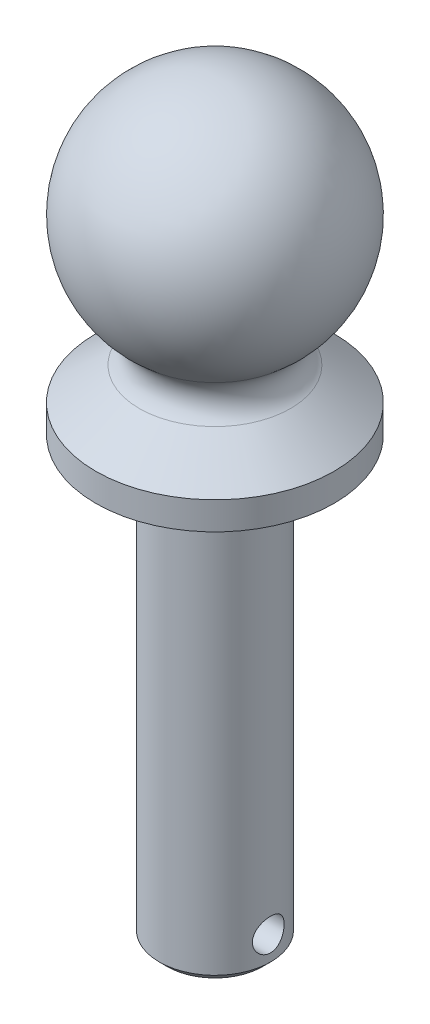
ISO-10303-21;
HEADER;
FILE_DESCRIPTION(('STEP AP214'),'2;1');
FILE_NAME('part.step','',(''),(''),'','','');
FILE_SCHEMA(('AUTOMOTIVE_DESIGN { 1 0 10303 214 1 1 1 1 }'));
ENDSEC;
DATA;
#1=APPLICATION_CONTEXT('core data for automotive mechanical design processes');
#2=APPLICATION_PROTOCOL_DEFINITION('international standard','automotive_design',2000,#1);
#3=PRODUCT_CONTEXT('',#1,'mechanical');
#4=PRODUCT('Part','Part','',(#3));
#5=PRODUCT_RELATED_PRODUCT_CATEGORY('part','',(#4));
#6=PRODUCT_DEFINITION_FORMATION('','',#4);
#7=PRODUCT_DEFINITION_CONTEXT('part definition',#1,'design');
#8=PRODUCT_DEFINITION('design','',#6,#7);
#9=PRODUCT_DEFINITION_SHAPE('','',#8);
#10=(LENGTH_UNIT() NAMED_UNIT(*) SI_UNIT(.MILLI.,.METRE.));
#11=(NAMED_UNIT(*) PLANE_ANGLE_UNIT() SI_UNIT($,.RADIAN.));
#12=(NAMED_UNIT(*) SI_UNIT($,.STERADIAN.) SOLID_ANGLE_UNIT());
#13=UNCERTAINTY_MEASURE_WITH_UNIT(LENGTH_MEASURE(1.E-05),#10,'distance_accuracy_value','');
#14=(GEOMETRIC_REPRESENTATION_CONTEXT(3) GLOBAL_UNCERTAINTY_ASSIGNED_CONTEXT((#13)) GLOBAL_UNIT_ASSIGNED_CONTEXT((#10,
#11,#12)) REPRESENTATION_CONTEXT('',''));
#15=CARTESIAN_POINT('',(0.,0.,0.));
#16=DIRECTION('',(0.,0.,1.));
#17=DIRECTION('',(1.,0.,0.));
#18=AXIS2_PLACEMENT_3D('',#15,#16,#17);
#19=CARTESIAN_POINT('',(0.,0.,0.));
#20=DIRECTION('',(0.,1.,0.));
#21=DIRECTION('',(1.,0.,0.));
#22=AXIS2_PLACEMENT_3D('',#19,#20,#21);
#23=SPHERICAL_SURFACE('',#22,15.);
#24=CARTESIAN_POINT('',(0.,-11.659704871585,0.));
#25=DIRECTION('',(0.,1.,0.));
#26=DIRECTION('',(0.,0.,1.));
#27=AXIS2_PLACEMENT_3D('',#24,#25,#26);
#28=CIRCLE('',#27,9.43669869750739);
#29=CARTESIAN_POINT('',(0.,-11.659704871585,9.43669869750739));
#30=VERTEX_POINT('',#29);
#31=EDGE_CURVE('E12',#30,#30,#28,.T.);
#32=ORIENTED_EDGE('',*,*,#31,.T.);
#33=EDGE_LOOP('',(#32));
#34=FACE_BOUND('',#33,.T.);
#35=ADVANCED_FACE('F38',(#34),#23,.T.);
#36=CARTESIAN_POINT('',(0.,-13.991645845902,0.));
#37=DIRECTION('',(0.,1.,0.));
#38=DIRECTION('',(0.,0.,1.));
#39=AXIS2_PLACEMENT_3D('',#36,#37,#38);
#40=TOROIDAL_SURFACE('',#39,11.3240384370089,3.);
#41=CARTESIAN_POINT('',(0.,-16.3913549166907,0.));
#42=DIRECTION('',(0.,1.,0.));
#43=DIRECTION('',(0.,0.,1.));
#44=AXIS2_PLACEMENT_3D('',#41,#42,#43);
#45=CIRCLE('',#44,9.52365059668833);
#46=CARTESIAN_POINT('',(0.,-16.3913549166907,9.52365059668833));
#47=VERTEX_POINT('',#46);
#48=EDGE_CURVE('E49',#47,#47,#45,.T.);
#49=ORIENTED_EDGE('',*,*,#48,.T.);
#50=EDGE_LOOP('',(#49));
#51=FACE_BOUND('',#50,.T.);
#52=ORIENTED_EDGE('',*,*,#31,.F.);
#53=EDGE_LOOP('',(#52));
#54=FACE_BOUND('',#53,.T.);
#55=ADVANCED_FACE('F85',(#51,#54),#40,.F.);
#56=CARTESIAN_POINT('',(0.,-16.3913549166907,0.));
#57=DIRECTION('',(0.,-1.,0.));
#58=DIRECTION('',(0.,0.,-1.));
#59=AXIS2_PLACEMENT_3D('',#56,#57,#58);
#60=CONICAL_SURFACE('',#59,9.52365059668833,0.927133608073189);
#61=CARTESIAN_POINT('',(0.,-20.5,0.));
#62=DIRECTION('',(0.,1.,0.));
#63=DIRECTION('',(0.,0.,1.));
#64=AXIS2_PLACEMENT_3D('',#61,#62,#63);
#65=CIRCLE('',#64,15.);
#66=CARTESIAN_POINT('',(0.,-20.5,15.));
#67=VERTEX_POINT('',#66);
#68=EDGE_CURVE('E54',#67,#67,#65,.T.);
#69=ORIENTED_EDGE('',*,*,#68,.T.);
#70=EDGE_LOOP('',(#69));
#71=FACE_BOUND('',#70,.T.);
#72=ORIENTED_EDGE('',*,*,#48,.F.);
#73=EDGE_LOOP('',(#72));
#74=FACE_BOUND('',#73,.T.);
#75=ADVANCED_FACE('F89',(#71,#74),#60,.T.);
#76=CARTESIAN_POINT('',(0.,-80.,0.));
#77=DIRECTION('',(0.,1.,0.));
#78=DIRECTION('',(0.,0.,1.));
#79=AXIS2_PLACEMENT_3D('',#76,#77,#78);
#80=CYLINDRICAL_SURFACE('',#79,15.);
#81=CARTESIAN_POINT('',(0.,-24.,0.));
#82=DIRECTION('',(0.,1.,0.));
#83=DIRECTION('',(0.,0.,1.));
#84=AXIS2_PLACEMENT_3D('',#81,#82,#83);
#85=CIRCLE('',#84,15.);
#86=CARTESIAN_POINT('',(0.,-24.,15.));
#87=VERTEX_POINT('',#86);
#88=EDGE_CURVE('E111',#87,#87,#85,.T.);
#89=ORIENTED_EDGE('',*,*,#88,.T.);
#90=EDGE_LOOP('',(#89));
#91=FACE_BOUND('',#90,.T.);
#92=ORIENTED_EDGE('',*,*,#68,.F.);
#93=EDGE_LOOP('',(#92));
#94=FACE_BOUND('',#93,.T.);
#95=ADVANCED_FACE('F94',(#91,#94),#80,.T.);
#96=CARTESIAN_POINT('',(-7.,-24.,0.));
#97=DIRECTION('',(0.,-1.,0.));
#98=DIRECTION('',(0.,0.,-1.));
#99=AXIS2_PLACEMENT_3D('',#96,#97,#98);
#100=PLANE('',#99);
#101=CARTESIAN_POINT('',(0.,-24.,0.));
#102=DIRECTION('',(0.,1.,0.));
#103=DIRECTION('',(0.,0.,1.));
#104=AXIS2_PLACEMENT_3D('',#101,#102,#103);
#105=CIRCLE('',#104,7.);
#106=CARTESIAN_POINT('',(0.,-24.,7.));
#107=VERTEX_POINT('',#106);
#108=EDGE_CURVE('E108',#107,#107,#105,.T.);
#109=ORIENTED_EDGE('',*,*,#108,.T.);
#110=EDGE_LOOP('',(#109));
#111=FACE_BOUND('',#110,.T.);
#112=ORIENTED_EDGE('',*,*,#88,.F.);
#113=EDGE_LOOP('',(#112));
#114=FACE_BOUND('',#113,.T.);
#115=ADVANCED_FACE('F80',(#111,#114),#100,.T.);
#116=CARTESIAN_POINT('',(0.,-80.,0.));
#117=DIRECTION('',(0.,1.,0.));
#118=DIRECTION('',(0.,0.,1.));
#119=AXIS2_PLACEMENT_3D('',#116,#117,#118);
#120=CYLINDRICAL_SURFACE('',#119,7.);
#121=CARTESIAN_POINT('',(-6.70820393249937,-75.,-2.));
#122=CARTESIAN_POINT('',(-6.70820547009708,-75.1098515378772,-1.99999802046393));
#123=CARTESIAN_POINT('',(-6.71093179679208,-75.2197230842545,-1.9909186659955));
#124=CARTESIAN_POINT('',(-6.72150389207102,-75.436271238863,-1.95492363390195));
#125=CARTESIAN_POINT('',(-6.72935174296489,-75.5429465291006,-1.92800070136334));
#126=CARTESIAN_POINT('',(-6.74920709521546,-75.7499372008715,-1.85729343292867));
#127=CARTESIAN_POINT('',(-6.76120815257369,-75.8502621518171,-1.81353520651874));
#128=CARTESIAN_POINT('',(-6.78800921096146,-76.0421678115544,-1.71048364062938));
#129=CARTESIAN_POINT('',(-6.80280954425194,-76.133747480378,-1.65118845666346));
#130=CARTESIAN_POINT('',(-6.83401783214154,-76.3081915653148,-1.51692480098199));
#131=CARTESIAN_POINT('',(-6.8504575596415,-76.3907678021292,-1.4415892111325));
#132=CARTESIAN_POINT('',(-6.88281965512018,-76.5423027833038,-1.27817124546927));
#133=CARTESIAN_POINT('',(-6.89874196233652,-76.6112599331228,-1.19008737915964));
#134=CARTESIAN_POINT('',(-6.92863332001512,-76.7348286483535,-1.00164603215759));
#135=CARTESIAN_POINT('',(-6.94256054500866,-76.789149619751,-0.90109078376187));
#136=CARTESIAN_POINT('',(-6.96652540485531,-76.880001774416,-0.691808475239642));
#137=CARTESIAN_POINT('',(-6.97656379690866,-76.9165364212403,-0.583083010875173));
#138=CARTESIAN_POINT('',(-6.99139519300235,-76.9698344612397,-0.363558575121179));
#139=CARTESIAN_POINT('',(-6.99631827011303,-76.9870890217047,-0.252887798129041));
#140=CARTESIAN_POINT('',(-7.00082095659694,-77.0028867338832,-0.0301201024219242));
#141=CARTESIAN_POINT('',(-7.00040158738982,-77.0014334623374,0.0819765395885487));
#142=CARTESIAN_POINT('',(-6.99436006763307,-76.980193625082,0.300980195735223));
#143=CARTESIAN_POINT('',(-6.98888870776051,-76.960938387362,0.40794354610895));
#144=CARTESIAN_POINT('',(-6.97353886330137,-76.9055048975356,0.61705222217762));
#145=CARTESIAN_POINT('',(-6.96366011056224,-76.8693256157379,0.719197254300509));
#146=CARTESIAN_POINT('',(-6.94039031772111,-76.7806905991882,0.917073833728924));
#147=CARTESIAN_POINT('',(-6.92696205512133,-76.7280612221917,1.01272304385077));
#148=CARTESIAN_POINT('',(-6.89802768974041,-76.608155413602,1.19400724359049));
#149=CARTESIAN_POINT('',(-6.8825211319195,-76.5408757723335,1.27964003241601));
#150=CARTESIAN_POINT('',(-6.85045683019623,-76.3907942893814,1.44163264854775));
#151=CARTESIAN_POINT('',(-6.83388129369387,-76.3075305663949,1.5175615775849));
#152=CARTESIAN_POINT('',(-6.80202973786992,-76.129284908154,1.65449301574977));
#153=CARTESIAN_POINT('',(-6.78675382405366,-76.034302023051,1.71549431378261));
#154=CARTESIAN_POINT('',(-6.75915174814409,-75.834269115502,1.82123335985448));
#155=CARTESIAN_POINT('',(-6.74685010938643,-75.7291447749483,1.86583737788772));
#156=CARTESIAN_POINT('',(-6.72688544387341,-75.5124468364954,1.9365895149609));
#157=CARTESIAN_POINT('',(-6.71922106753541,-75.4008751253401,1.9627430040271));
#158=CARTESIAN_POINT('',(-6.70969115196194,-75.1785195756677,1.99507417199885));
#159=CARTESIAN_POINT('',(-6.70763711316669,-75.067838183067,2.00190148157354));
#160=CARTESIAN_POINT('',(-6.7090415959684,-74.846911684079,1.99718996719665));
#161=CARTESIAN_POINT('',(-6.71249942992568,-74.7366665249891,1.98565343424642));
#162=CARTESIAN_POINT('',(-6.72435430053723,-74.5223587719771,1.94511781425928));
#163=CARTESIAN_POINT('',(-6.73263642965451,-74.4182124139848,1.9165246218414));
#164=CARTESIAN_POINT('',(-6.75309063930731,-74.2161981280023,1.8431516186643));
#165=CARTESIAN_POINT('',(-6.7652632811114,-74.1183311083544,1.79836947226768));
#166=CARTESIAN_POINT('',(-6.79250188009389,-73.9289779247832,1.69261965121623));
#167=CARTESIAN_POINT('',(-6.80763197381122,-73.8377095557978,1.63127891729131));
#168=CARTESIAN_POINT('',(-6.83893726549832,-73.6665236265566,1.49460463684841));
#169=CARTESIAN_POINT('',(-6.85511268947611,-73.5866085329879,1.41926805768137));
#170=CARTESIAN_POINT('',(-6.88734727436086,-73.4376205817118,1.25370800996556));
#171=CARTESIAN_POINT('',(-6.90338406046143,-73.3690050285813,1.16306771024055));
#172=CARTESIAN_POINT('',(-6.93297977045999,-73.2479543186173,0.971185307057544));
#173=CARTESIAN_POINT('',(-6.94653882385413,-73.1955183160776,0.869943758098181));
#174=CARTESIAN_POINT('',(-6.96956504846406,-73.1088157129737,0.660433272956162));
#175=CARTESIAN_POINT('',(-6.97906308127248,-73.0744116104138,0.552224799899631));
#176=CARTESIAN_POINT('',(-6.99303339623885,-73.0243731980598,0.33124564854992));
#177=CARTESIAN_POINT('',(-6.99750697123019,-73.0087340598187,0.218476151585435));
#178=CARTESIAN_POINT('',(-7.00085335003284,-72.9970085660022,-0.00417823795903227));
#179=CARTESIAN_POINT('',(-6.99991703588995,-73.0002558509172,-0.11402563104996));
#180=CARTESIAN_POINT('',(-6.99299069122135,-73.0246382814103,-0.331545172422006));
#181=CARTESIAN_POINT('',(-6.98700090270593,-73.045772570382,-0.439217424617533));
#182=CARTESIAN_POINT('',(-6.97068801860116,-73.1049313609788,-0.648404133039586));
#183=CARTESIAN_POINT('',(-6.96040414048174,-73.142803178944,-0.749965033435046));
#184=CARTESIAN_POINT('',(-6.93657094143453,-73.2342261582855,-0.945347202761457));
#185=CARTESIAN_POINT('',(-6.92302111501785,-73.2877797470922,-1.03916727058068));
#186=CARTESIAN_POINT('',(-6.89358955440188,-73.4108973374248,-1.2194334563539));
#187=CARTESIAN_POINT('',(-6.8776504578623,-73.4808900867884,-1.30557732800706));
#188=CARTESIAN_POINT('',(-6.84544064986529,-73.6341091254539,-1.46512122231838));
#189=CARTESIAN_POINT('',(-6.82916984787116,-73.7173390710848,-1.5385177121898));
#190=CARTESIAN_POINT('',(-6.79764037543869,-73.8972969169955,-1.67240846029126));
#191=CARTESIAN_POINT('',(-6.78241951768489,-73.9943219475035,-1.73251316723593));
#192=CARTESIAN_POINT('',(-6.7552844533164,-74.1975218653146,-1.83547943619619));
#193=CARTESIAN_POINT('',(-6.74336839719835,-74.3036915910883,-1.8783506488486));
#194=CARTESIAN_POINT('',(-6.72558459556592,-74.5076537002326,-1.94098534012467));
#195=CARTESIAN_POINT('',(-6.71912438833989,-74.6046903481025,-1.96305899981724));
#196=CARTESIAN_POINT('',(-6.71043369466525,-74.8011461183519,-1.99256607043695));
#197=CARTESIAN_POINT('',(-6.70820254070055,-74.9005648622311,-2.00000179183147));
#198=CARTESIAN_POINT('',(-6.70820393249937,-75.,-2.));
#199=B_SPLINE_CURVE_WITH_KNOTS('',3,(#121,#122,#123,#124,#125,#126,#127,#128,#129,#130,#131,
#132,#133,#134,#135,#136,#137,#138,#139,#140,#141,#142,#143,#144,#145,#146,#147,#148,#149,#150,
#151,#152,#153,#154,#155,#156,#157,#158,#159,#160,#161,#162,#163,#164,#165,#166,#167,#168,#169,
#170,#171,#172,#173,#174,#175,#176,#177,#178,#179,#180,#181,#182,#183,#184,#185,#186,#187,#188,
#189,#190,#191,#192,#193,#194,#195,#196,#197,#198),.UNSPECIFIED.,.T.,.F.,(4,2,2,2,2,2,2,2,2,2,2,
2,2,2,2,2,2,2,2,2,2,2,2,2,2,2,2,2,2,2,2,2,2,2,2,2,2,2,4),(0.,0.329188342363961,
0.658510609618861,0.987324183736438,1.31617681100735,1.65357167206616,1.99100601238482,
2.33471483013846,2.67835669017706,3.01302901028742,3.34763734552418,3.67257037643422,
3.99752317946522,4.32602903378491,4.65460693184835,4.99471612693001,5.33485290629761,
5.67770520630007,6.02045767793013,6.35154363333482,6.68258828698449,7.00605289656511,
7.32956419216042,7.66108006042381,7.99266784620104,8.33545388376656,8.67822200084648,
9.01833685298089,9.35836417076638,9.6864689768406,10.0145580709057,10.3397141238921,
10.6649205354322,10.9997976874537,11.3347674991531,11.6785361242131,12.0221119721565,
12.3201328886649,12.61810676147),.UNSPECIFIED.);
#200=CARTESIAN_POINT('',(-6.70820393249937,-75.,-2.));
#201=VERTEX_POINT('',#200);
#202=EDGE_CURVE('E41',#201,#201,#199,.T.);
#203=ORIENTED_EDGE('',*,*,#202,.F.);
#204=EDGE_LOOP('',(#203));
#205=FACE_BOUND('',#204,.T.);
#206=CARTESIAN_POINT('',(6.70820393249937,-75.,-2.));
#207=CARTESIAN_POINT('',(6.70820547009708,-74.8901484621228,-1.99999802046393));
#208=CARTESIAN_POINT('',(6.71093179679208,-74.7802769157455,-1.9909186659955));
#209=CARTESIAN_POINT('',(6.72150389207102,-74.563728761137,-1.95492363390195));
#210=CARTESIAN_POINT('',(6.72935174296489,-74.4570534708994,-1.92800070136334));
#211=CARTESIAN_POINT('',(6.74920709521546,-74.2500627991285,-1.85729343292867));
#212=CARTESIAN_POINT('',(6.76120815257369,-74.1497378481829,-1.81353520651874));
#213=CARTESIAN_POINT('',(6.78800921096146,-73.9578321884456,-1.71048364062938));
#214=CARTESIAN_POINT('',(6.80280954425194,-73.866252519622,-1.65118845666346));
#215=CARTESIAN_POINT('',(6.83401783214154,-73.6918084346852,-1.51692480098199));
#216=CARTESIAN_POINT('',(6.8504575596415,-73.6092321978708,-1.4415892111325));
#217=CARTESIAN_POINT('',(6.88281965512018,-73.4576972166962,-1.27817124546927));
#218=CARTESIAN_POINT('',(6.89874196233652,-73.3887400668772,-1.19008737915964));
#219=CARTESIAN_POINT('',(6.92863332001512,-73.2651713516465,-1.00164603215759));
#220=CARTESIAN_POINT('',(6.94256054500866,-73.210850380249,-0.90109078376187));
#221=CARTESIAN_POINT('',(6.96652540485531,-73.119998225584,-0.691808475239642));
#222=CARTESIAN_POINT('',(6.97656379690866,-73.0834635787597,-0.583083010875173));
#223=CARTESIAN_POINT('',(6.99139519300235,-73.0301655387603,-0.363558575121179));
#224=CARTESIAN_POINT('',(6.99631827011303,-73.0129109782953,-0.252887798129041));
#225=CARTESIAN_POINT('',(7.00082095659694,-72.9971132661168,-0.0301201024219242));
#226=CARTESIAN_POINT('',(7.00040158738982,-72.9985665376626,0.0819765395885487));
#227=CARTESIAN_POINT('',(6.99436006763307,-73.019806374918,0.300980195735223));
#228=CARTESIAN_POINT('',(6.98888870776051,-73.039061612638,0.40794354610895));
#229=CARTESIAN_POINT('',(6.97353886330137,-73.0944951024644,0.61705222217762));
#230=CARTESIAN_POINT('',(6.96366011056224,-73.1306743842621,0.719197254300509));
#231=CARTESIAN_POINT('',(6.94039031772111,-73.2193094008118,0.917073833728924));
#232=CARTESIAN_POINT('',(6.92696205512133,-73.2719387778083,1.01272304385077));
#233=CARTESIAN_POINT('',(6.89802768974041,-73.391844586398,1.19400724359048));
#234=CARTESIAN_POINT('',(6.8825211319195,-73.4591242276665,1.27964003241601));
#235=CARTESIAN_POINT('',(6.85045683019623,-73.6092057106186,1.44163264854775));
#236=CARTESIAN_POINT('',(6.83388129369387,-73.692469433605,1.51756157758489));
#237=CARTESIAN_POINT('',(6.80202973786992,-73.870715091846,1.65449301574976));
#238=CARTESIAN_POINT('',(6.78675382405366,-73.965697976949,1.71549431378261));
#239=CARTESIAN_POINT('',(6.75915174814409,-74.165730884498,1.82123335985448));
#240=CARTESIAN_POINT('',(6.74685010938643,-74.2708552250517,1.86583737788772));
#241=CARTESIAN_POINT('',(6.72688544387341,-74.4875531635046,1.9365895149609));
#242=CARTESIAN_POINT('',(6.71922106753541,-74.5991248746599,1.9627430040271));
#243=CARTESIAN_POINT('',(6.70969115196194,-74.8214804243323,1.99507417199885));
#244=CARTESIAN_POINT('',(6.70763711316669,-74.932161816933,2.00190148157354));
#245=CARTESIAN_POINT('',(6.7090415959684,-75.153088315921,1.99718996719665));
#246=CARTESIAN_POINT('',(6.71249942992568,-75.2633334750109,1.98565343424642));
#247=CARTESIAN_POINT('',(6.72435430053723,-75.4776412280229,1.94511781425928));
#248=CARTESIAN_POINT('',(6.73263642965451,-75.5817875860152,1.9165246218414));
#249=CARTESIAN_POINT('',(6.75309063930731,-75.7838018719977,1.8431516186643));
#250=CARTESIAN_POINT('',(6.7652632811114,-75.8816688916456,1.79836947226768));
#251=CARTESIAN_POINT('',(6.79250188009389,-76.0710220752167,1.69261965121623));
#252=CARTESIAN_POINT('',(6.80763197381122,-76.1622904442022,1.63127891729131));
#253=CARTESIAN_POINT('',(6.83893726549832,-76.3334763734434,1.49460463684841));
#254=CARTESIAN_POINT('',(6.85511268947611,-76.4133914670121,1.41926805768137));
#255=CARTESIAN_POINT('',(6.88734727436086,-76.5623794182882,1.25370800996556));
#256=CARTESIAN_POINT('',(6.90338406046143,-76.6309949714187,1.16306771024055));
#257=CARTESIAN_POINT('',(6.93297977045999,-76.7520456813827,0.971185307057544));
#258=CARTESIAN_POINT('',(6.94653882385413,-76.8044816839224,0.869943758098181));
#259=CARTESIAN_POINT('',(6.96956504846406,-76.8911842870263,0.660433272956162));
#260=CARTESIAN_POINT('',(6.97906308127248,-76.9255883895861,0.552224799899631));
#261=CARTESIAN_POINT('',(6.99303339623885,-76.9756268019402,0.33124564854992));
#262=CARTESIAN_POINT('',(6.99750697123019,-76.9912659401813,0.218476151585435));
#263=CARTESIAN_POINT('',(7.00085335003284,-77.0029914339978,-0.00417823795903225));
#264=CARTESIAN_POINT('',(6.99991703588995,-76.9997441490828,-0.11402563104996));
#265=CARTESIAN_POINT('',(6.99299069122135,-76.9753617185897,-0.331545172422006));
#266=CARTESIAN_POINT('',(6.98700090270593,-76.954227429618,-0.439217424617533));
#267=CARTESIAN_POINT('',(6.97068801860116,-76.8950686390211,-0.648404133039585));
#268=CARTESIAN_POINT('',(6.96040414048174,-76.857196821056,-0.749965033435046));
#269=CARTESIAN_POINT('',(6.93657094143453,-76.7657738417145,-0.945347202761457));
#270=CARTESIAN_POINT('',(6.92302111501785,-76.7122202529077,-1.03916727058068));
#271=CARTESIAN_POINT('',(6.89358955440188,-76.5891026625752,-1.2194334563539));
#272=CARTESIAN_POINT('',(6.8776504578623,-76.5191099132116,-1.30557732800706));
#273=CARTESIAN_POINT('',(6.8454406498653,-76.3658908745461,-1.46512122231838));
#274=CARTESIAN_POINT('',(6.82916984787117,-76.2826609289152,-1.5385177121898));
#275=CARTESIAN_POINT('',(6.79764037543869,-76.1027030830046,-1.67240846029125));
#276=CARTESIAN_POINT('',(6.7824195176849,-76.0056780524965,-1.73251316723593));
#277=CARTESIAN_POINT('',(6.7552844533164,-75.8024781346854,-1.83547943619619));
#278=CARTESIAN_POINT('',(6.74336839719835,-75.6963084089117,-1.8783506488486));
#279=CARTESIAN_POINT('',(6.72558459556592,-75.4923462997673,-1.94098534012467));
#280=CARTESIAN_POINT('',(6.71912438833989,-75.3953096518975,-1.96305899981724));
#281=CARTESIAN_POINT('',(6.71043369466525,-75.1988538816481,-1.99256607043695));
#282=CARTESIAN_POINT('',(6.70820254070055,-75.0994351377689,-2.00000179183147));
#283=CARTESIAN_POINT('',(6.70820393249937,-75.,-2.));
#284=B_SPLINE_CURVE_WITH_KNOTS('',3,(#206,#207,#208,#209,#210,#211,#212,#213,#214,#215,#216,
#217,#218,#219,#220,#221,#222,#223,#224,#225,#226,#227,#228,#229,#230,#231,#232,#233,#234,#235,
#236,#237,#238,#239,#240,#241,#242,#243,#244,#245,#246,#247,#248,#249,#250,#251,#252,#253,#254,
#255,#256,#257,#258,#259,#260,#261,#262,#263,#264,#265,#266,#267,#268,#269,#270,#271,#272,#273,
#274,#275,#276,#277,#278,#279,#280,#281,#282,#283),.UNSPECIFIED.,.T.,.F.,(4,2,2,2,2,2,2,2,2,2,2,
2,2,2,2,2,2,2,2,2,2,2,2,2,2,2,2,2,2,2,2,2,2,2,2,2,2,2,4),(0.,0.329188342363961,
0.658510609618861,0.987324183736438,1.31617681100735,1.65357167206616,1.99100601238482,
2.33471483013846,2.67835669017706,3.01302901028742,3.34763734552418,3.67257037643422,
3.99752317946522,4.32602903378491,4.65460693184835,4.99471612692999,5.33485290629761,
5.67770520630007,6.02045767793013,6.35154363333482,6.68258828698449,7.00605289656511,
7.32956419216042,7.66108006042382,7.99266784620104,8.33545388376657,8.67822200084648,
9.0183368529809,9.35836417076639,9.68646897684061,10.0145580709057,10.3397141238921,
10.6649205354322,10.9997976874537,11.3347674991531,11.678536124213,12.0221119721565,
12.3201328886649,12.61810676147),.UNSPECIFIED.);
#285=CARTESIAN_POINT('',(6.70820393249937,-75.,-2.));
#286=VERTEX_POINT('',#285);
#287=EDGE_CURVE('E57',#286,#286,#284,.T.);
#288=ORIENTED_EDGE('',*,*,#287,.F.);
#289=EDGE_LOOP('',(#288));
#290=FACE_BOUND('',#289,.T.);
#291=CARTESIAN_POINT('',(0.,-78.,0.));
#292=DIRECTION('',(0.,1.,0.));
#293=DIRECTION('',(0.,0.,1.));
#294=AXIS2_PLACEMENT_3D('',#291,#292,#293);
#295=CIRCLE('',#294,7.);
#296=CARTESIAN_POINT('',(0.,-78.,7.));
#297=VERTEX_POINT('',#296);
#298=EDGE_CURVE('E114',#297,#297,#295,.T.);
#299=ORIENTED_EDGE('',*,*,#298,.T.);
#300=EDGE_LOOP('',(#299));
#301=FACE_BOUND('',#300,.T.);
#302=ORIENTED_EDGE('',*,*,#108,.F.);
#303=EDGE_LOOP('',(#302));
#304=FACE_BOUND('',#303,.T.);
#305=ADVANCED_FACE('F61',(#205,#290,#301,#304),#120,.T.);
#306=CARTESIAN_POINT('',(0.,-78.,0.));
#307=DIRECTION('',(0.,1.,0.));
#308=DIRECTION('',(0.,0.,1.));
#309=AXIS2_PLACEMENT_3D('',#306,#307,#308);
#310=CONICAL_SURFACE('',#309,7.,0.785398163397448);
#311=CARTESIAN_POINT('',(0.,-79.,0.));
#312=DIRECTION('',(0.,1.,0.));
#313=DIRECTION('',(0.,0.,1.));
#314=AXIS2_PLACEMENT_3D('',#311,#312,#313);
#315=CIRCLE('',#314,6.);
#316=CARTESIAN_POINT('',(0.,-79.,6.));
#317=VERTEX_POINT('',#316);
#318=EDGE_CURVE('E119',#317,#317,#315,.T.);
#319=ORIENTED_EDGE('',*,*,#318,.T.);
#320=EDGE_LOOP('',(#319));
#321=FACE_BOUND('',#320,.T.);
#322=ORIENTED_EDGE('',*,*,#298,.F.);
#323=EDGE_LOOP('',(#322));
#324=FACE_BOUND('',#323,.T.);
#325=ADVANCED_FACE('F73',(#321,#324),#310,.T.);
#326=CARTESIAN_POINT('',(0.,-79.,0.));
#327=DIRECTION('',(0.,-1.,0.));
#328=DIRECTION('',(0.,0.,-1.));
#329=AXIS2_PLACEMENT_3D('',#326,#327,#328);
#330=PLANE('',#329);
#331=ORIENTED_EDGE('',*,*,#318,.F.);
#332=EDGE_LOOP('',(#331));
#333=FACE_BOUND('',#332,.T.);
#334=ADVANCED_FACE('F69',(#333),#330,.T.);
#335=CARTESIAN_POINT('',(-15.,-75.,0.));
#336=DIRECTION('',(1.,0.,0.));
#337=DIRECTION('',(0.,0.,-1.));
#338=AXIS2_PLACEMENT_3D('',#335,#336,#337);
#339=CYLINDRICAL_SURFACE('',#338,2.);
#340=ORIENTED_EDGE('',*,*,#202,.T.);
#341=EDGE_LOOP('',(#340));
#342=FACE_BOUND('',#341,.T.);
#343=ORIENTED_EDGE('',*,*,#287,.T.);
#344=EDGE_LOOP('',(#343));
#345=FACE_BOUND('',#344,.T.);
#346=ADVANCED_FACE('F65',(#342,#345),#339,.F.);
#347=CLOSED_SHELL('',(#35,#55,#75,#95,#115,#305,#325,#334,#346));
#348=MANIFOLD_SOLID_BREP('B2',#347);
#349=ADVANCED_BREP_SHAPE_REPRESENTATION('',(#18,#348),#14);
#350=SHAPE_DEFINITION_REPRESENTATION(#9,#349);
ENDSEC;
END-ISO-10303-21;
